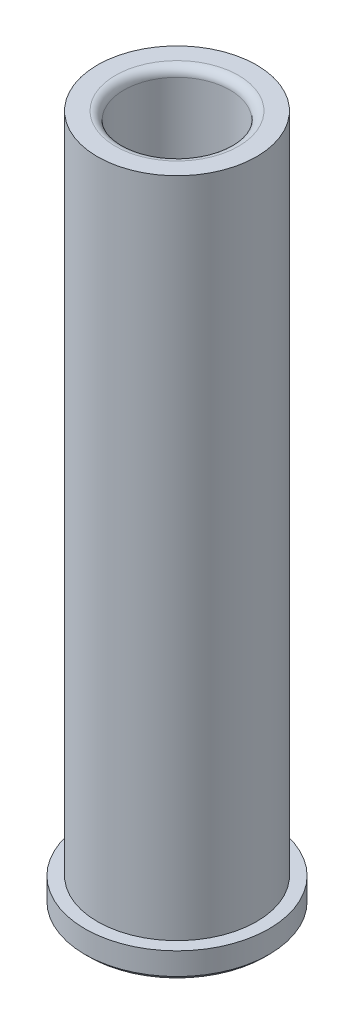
from build123d import *

# Parameters (mm, degrees)
FILLET1_R = 1.524


with BuildPart() as part:
    # Sketch1 → Revolve1 (revolve)
    with BuildSketch(Plane.XY, mode=Mode.PRIVATE) as revolve1_sk:
        Polygon((-15.7734, 0), (-16.5354, 0.762), (-16.5354, 4.7625), (-14.29385, 4.7625), (-14.29385, 123.825), (-9.53135, 123.825), (-9.53135, 0.762), (-10.29335, 0), align=None)
    revolve(revolve1_sk.sketch.rotate(Axis((0, -1000, 0), (0, 1, 0)), 180), axis=Axis((0, -1000, 0), (0, 1, 0)))

    # Fillet1
    fillet1_edges = [part.edges().sort_by_distance(p)[0] for p in [
        (-9.53135, 123.825, 0),
    ]]
    fillet(fillet1_edges, radius=FILLET1_R)


solid = part.part
